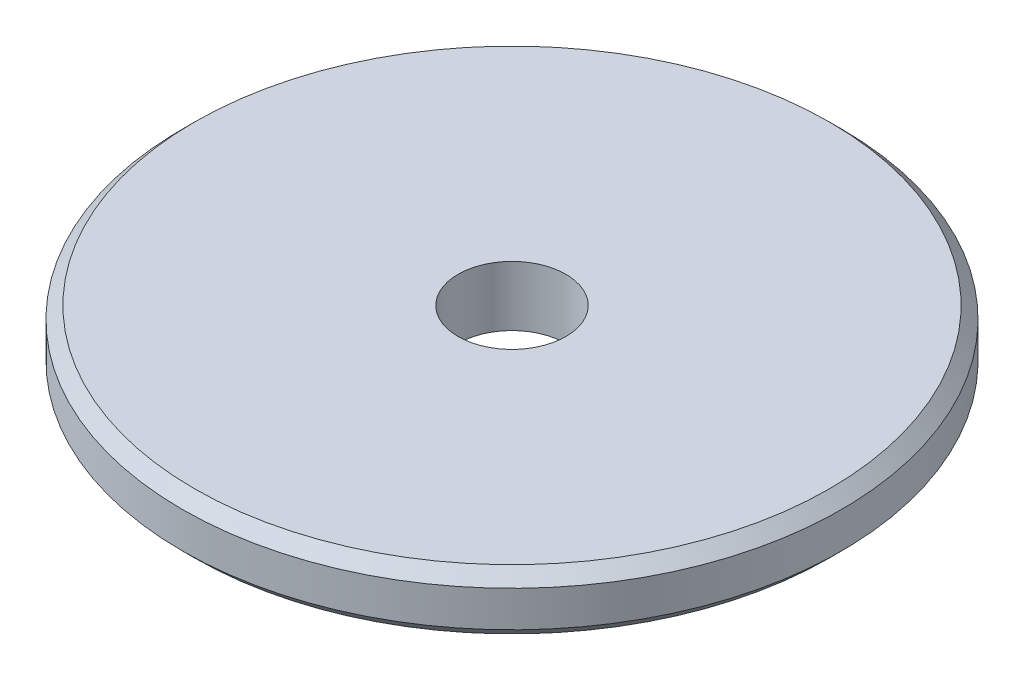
from build123d import *

# Parameters (mm, degrees)
SKETCH1_R      = 27.5
SKETCH1_R_2    = 4.5
EXTRUDE1_DEPTH = 5
CHAMFER1_SIZE  = 1


with BuildPart() as part:
    # Sketch1 → Extrude1 (new body)
    with BuildSketch(Plane(origin=(0, 0, 0), x_dir=(1, 0, 0), z_dir=(0, 1, 0))):
        with Locations(Location((0, 0, 0), (0, 0, 270))):
            Circle(SKETCH1_R)
        with Locations(Location((0, 0, 0), (0, 0, 270))):
            Circle(SKETCH1_R_2, mode=Mode.SUBTRACT)
    extrude(amount=EXTRUDE1_DEPTH)

    # Chamfer1
    chamfer1_edges = [part.edges().sort_by_distance(p)[0] for p in [
        (0, 0, -27.5),
        (0, 5, -27.5),
    ]]
    chamfer(chamfer1_edges, length=CHAMFER1_SIZE)


solid = part.part
